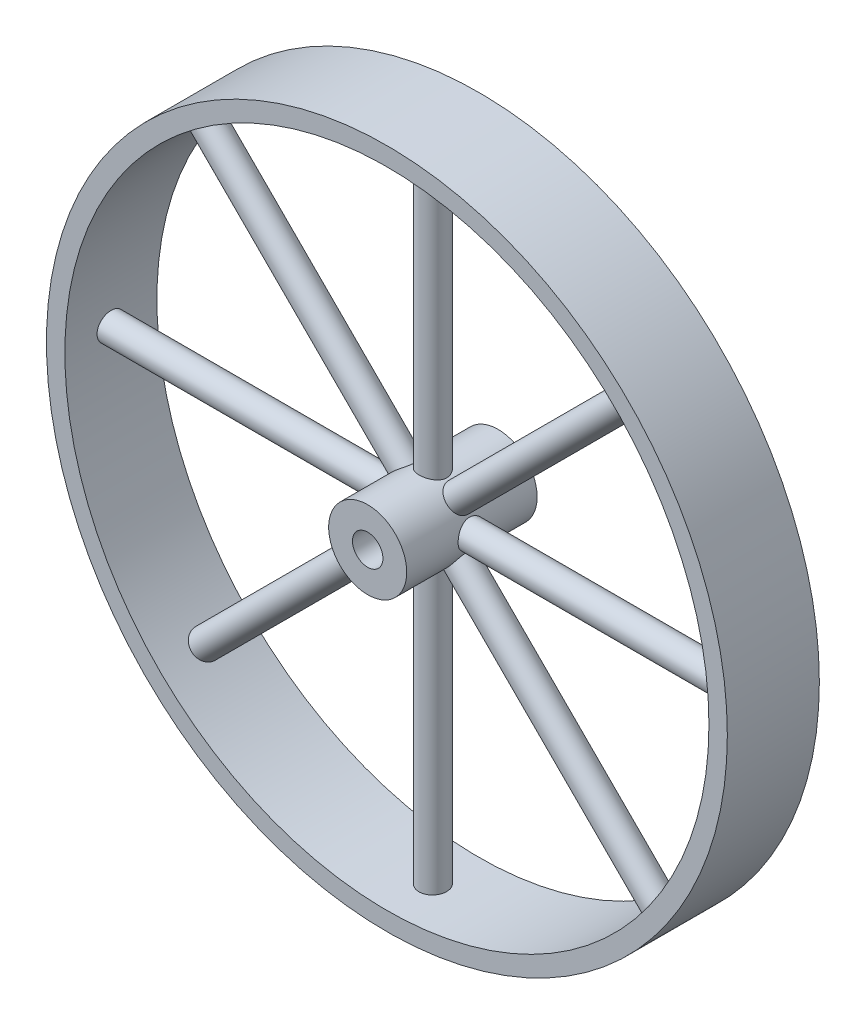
from build123d import *

# Parameters (mm, degrees)
SKETCH1_R                            = 46.99
SKETCH1_R_2                          = 44.45
EXTRUDE_THIN1_DEPTH                  = 6.35
SKETCH2_R                            = 5.386
SKETCH2_R_2                          = 2.1
EXTRUDE_THIN2_DEPTH                  = 9
BOSS_EXTRUDE1_REACH                  = 77.511
BOSS_EXTRUDE1_END_RADIUS             = 44.45
SKETCH3_R                            = 1.905
BOSS_EXTRUDE1_DIRECTION_2_REACH      = 77.511
BOSS_EXTRUDE1_DIRECTION_2_END_RADIUS = 5.386
CIRPATTERN1_COUNT                    = 8


with BuildPart() as part:
    # Sketch1 → Extrude-Thin1 (new, symmetric)
    with BuildSketch(Plane.XY):
        Circle(SKETCH1_R)
        Circle(SKETCH1_R_2, mode=Mode.SUBTRACT)
    extrude(amount=EXTRUDE_THIN1_DEPTH, both=True)



with BuildPart() as body_2:
    # Sketch2 → Extrude-Thin2 (new, symmetric)
    with BuildSketch(Plane.XY):
        Circle(SKETCH2_R)
        Circle(SKETCH2_R_2, mode=Mode.SUBTRACT)
    extrude(amount=EXTRUDE_THIN2_DEPTH, both=True)


with BuildPart() as part_1:
    add(part.part)

    add(body_2.part)  # Boss-Extrude1 merges body 2
    # Boss-Extrude1: up to this cylinder (the profile starts inside it)
    boss_extrude1_end = Plane(origin=(0, 0, 0), z_dir=(0, 0, -1)) * Cylinder(BOSS_EXTRUDE1_END_RADIUS, 244.922, mode=Mode.PRIVATE)
    # Sketch3 → Boss-Extrude1 (add, up to the surface)
    with BuildSketch(Plane(origin=(11.43, 0, 0), x_dir=(0, 0, -1), z_dir=(1, 0, 0)), mode=Mode.PRIVATE) as boss_extrude1_sk1:
        Circle(SKETCH3_R)
    boss_extrude1_tool1 = extrude(boss_extrude1_sk1.sketch, amount=BOSS_EXTRUDE1_REACH, mode=Mode.PRIVATE) & boss_extrude1_end
    boss_extrude1 = boss_extrude1_tool1.solids().sort_by_distance((11.43, 0, 0))[0]
    add(boss_extrude1)

    # Boss-Extrude1 direction 2: up to this cylinder (the profile starts outside it)
    boss_extrude1_direction_2_end = Plane(origin=(0, 0, 0), z_dir=(0, 0, -1)) * Cylinder(BOSS_EXTRUDE1_DIRECTION_2_END_RADIUS, 166.794, mode=Mode.PRIVATE)
    # Sketch3 → Boss-Extrude1 direction 2 (add, up to the surface)
    with BuildSketch(Plane(origin=(11.43, 0, 0), x_dir=(0, 0, -1), z_dir=(1, 0, 0)), mode=Mode.PRIVATE) as boss_extrude1_direction_2_sk1:
        Circle(SKETCH3_R)
    boss_extrude1_direction_2_tool1 = extrude(boss_extrude1_direction_2_sk1.sketch, amount=-BOSS_EXTRUDE1_DIRECTION_2_REACH, mode=Mode.PRIVATE) - boss_extrude1_direction_2_end
    boss_extrude1_direction_2 = boss_extrude1_direction_2_tool1.solids().sort_by_distance((11.43, 0, 0))[0]
    add(boss_extrude1_direction_2)
    boss_extrude1 = boss_extrude1 + boss_extrude1_direction_2  # both directions under the feature's name, for the pattern or mirror that repeats it

    # CirPattern1: Boss-Extrude1 ×8 about axis
    cirpattern1_axis = Axis((0, 0, 9), (0, 0, -1))
    for i in range(1, CIRPATTERN1_COUNT):
        add(boss_extrude1.rotate(cirpattern1_axis, i * 360 / CIRPATTERN1_COUNT))


solid = part_1.part
